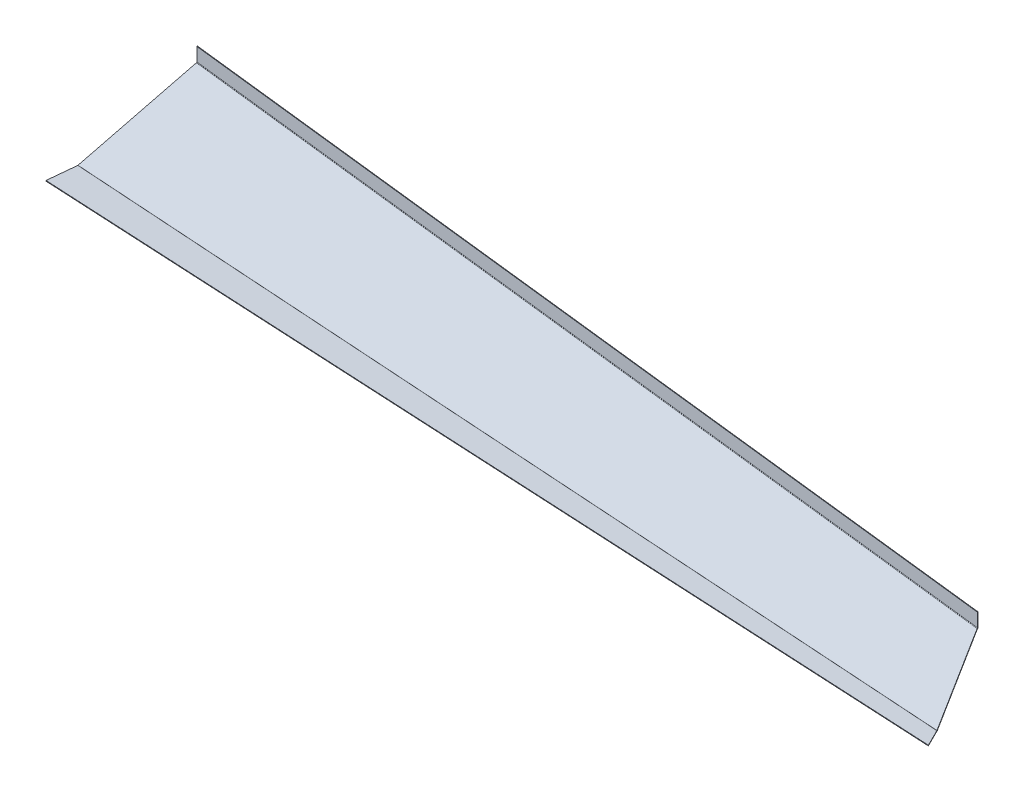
ISO-10303-21;
HEADER;
FILE_DESCRIPTION(('STEP AP214'),'2;1');
FILE_NAME('part.step','',(''),(''),'','','');
FILE_SCHEMA(('AUTOMOTIVE_DESIGN { 1 0 10303 214 1 1 1 1 }'));
ENDSEC;
DATA;
#1=APPLICATION_CONTEXT('core data for automotive mechanical design processes');
#2=APPLICATION_PROTOCOL_DEFINITION('international standard','automotive_design',2000,#1);
#3=PRODUCT_CONTEXT('',#1,'mechanical');
#4=PRODUCT('Part','Part','',(#3));
#5=PRODUCT_RELATED_PRODUCT_CATEGORY('part','',(#4));
#6=PRODUCT_DEFINITION_FORMATION('','',#4);
#7=PRODUCT_DEFINITION_CONTEXT('part definition',#1,'design');
#8=PRODUCT_DEFINITION('design','',#6,#7);
#9=PRODUCT_DEFINITION_SHAPE('','',#8);
#10=(LENGTH_UNIT() NAMED_UNIT(*) SI_UNIT(.MILLI.,.METRE.));
#11=(NAMED_UNIT(*) PLANE_ANGLE_UNIT() SI_UNIT($,.RADIAN.));
#12=(NAMED_UNIT(*) SI_UNIT($,.STERADIAN.) SOLID_ANGLE_UNIT());
#13=UNCERTAINTY_MEASURE_WITH_UNIT(LENGTH_MEASURE(1.E-05),#10,'distance_accuracy_value','');
#14=(GEOMETRIC_REPRESENTATION_CONTEXT(3) GLOBAL_UNCERTAINTY_ASSIGNED_CONTEXT((#13)) GLOBAL_UNIT_ASSIGNED_CONTEXT((#10,
#11,#12)) REPRESENTATION_CONTEXT('',''));
#15=CARTESIAN_POINT('',(0.,0.,0.));
#16=DIRECTION('',(0.,0.,1.));
#17=DIRECTION('',(1.,0.,0.));
#18=AXIS2_PLACEMENT_3D('',#15,#16,#17);
#19=CARTESIAN_POINT('',(2188.04468936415,21.5753010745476,-1143.95409208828));
#20=DIRECTION('',(0.891606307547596,0.156018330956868,-0.425084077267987));
#21=DIRECTION('',(-0.451666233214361,0.23970666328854,-0.859382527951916));
#22=AXIS2_PLACEMENT_3D('',#19,#20,#21);
#23=PLANE('',#22);
#24=DIRECTION('',(-0.0321839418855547,0.95822700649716,0.28419218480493));
#25=VECTOR('',#24,1.);
#26=CARTESIAN_POINT('',(2432.44738637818,-108.133210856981,-678.930603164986));
#27=LINE('',#26,#25);
#28=CARTESIAN_POINT('',(2432.49970459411,-109.690904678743,-679.392585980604));
#29=VERTEX_POINT('',#28);
#30=CARTESIAN_POINT('',(2432.44738637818,-108.133210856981,-678.930603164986));
#31=VERTEX_POINT('',#30);
#32=EDGE_CURVE('E13',#29,#31,#27,.T.);
#33=ORIENTED_EDGE('',*,*,#32,.F.);
#34=DIRECTION('',(-0.451666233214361,0.23970666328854,-0.859382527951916));
#35=VECTOR('',#34,1.);
#36=CARTESIAN_POINT('',(2188.09700758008,20.0176072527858,-1144.4160749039));
#37=LINE('',#36,#35);
#38=CARTESIAN_POINT('',(2313.93589779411,-46.7671516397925,-904.983202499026));
#39=VERTEX_POINT('',#38);
#40=EDGE_CURVE('E254',#29,#39,#37,.T.);
#41=ORIENTED_EDGE('',*,*,#40,.T.);
#42=DIRECTION('',(-0.0321839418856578,0.958227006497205,0.284192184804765));
#43=VECTOR('',#42,1.);
#44=CARTESIAN_POINT('',(2313.88357957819,-45.2094578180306,-904.521219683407));
#45=LINE('',#44,#43);
#46=CARTESIAN_POINT('',(2313.88357957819,-45.2094578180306,-904.521219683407));
#47=VERTEX_POINT('',#46);
#48=EDGE_CURVE('E207',#39,#47,#45,.T.);
#49=ORIENTED_EDGE('',*,*,#48,.T.);
#50=DIRECTION('',(-0.451666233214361,0.23970666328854,-0.859382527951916));
#51=VECTOR('',#50,1.);
#52=CARTESIAN_POINT('',(2188.04468936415,21.5753010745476,-1143.95409208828));
#53=LINE('',#52,#51);
#54=EDGE_CURVE('E256',#31,#47,#53,.T.);
#55=ORIENTED_EDGE('',*,*,#54,.F.);
#56=EDGE_LOOP('',(#33,#41,#49,#55));
#57=FACE_BOUND('',#56,.T.);
#58=ADVANCED_FACE('F194',(#57),#23,.T.);
#59=CARTESIAN_POINT('',(2315.05930535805,-43.6517639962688,-902.284173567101));
#60=CARTESIAN_POINT('',(2314.99833028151,-43.6517639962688,-901.74574852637));
#61=CARTESIAN_POINT('',(2314.93735520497,-43.6517639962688,-901.20732348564));
#62=CARTESIAN_POINT('',(2314.87638012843,-43.6517639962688,-900.66889844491));
#63=CARTESIAN_POINT('',(2315.05930535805,-46.9029639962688,-902.284173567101));
#64=CARTESIAN_POINT('',(2314.99833028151,-47.9866973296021,-901.74574852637));
#65=CARTESIAN_POINT('',(2314.93735520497,-49.0704306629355,-901.20732348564));
#66=CARTESIAN_POINT('',(2314.87638012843,-50.1541639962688,-900.66889844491));
#67=CARTESIAN_POINT('',(2313.23081736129,-46.9029639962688,-905.763226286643));
#68=CARTESIAN_POINT('',(2313.29179243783,-47.9866973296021,-906.301651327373));
#69=CARTESIAN_POINT('',(2313.35276751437,-49.0704306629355,-906.840076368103));
#70=CARTESIAN_POINT('',(2313.41374259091,-50.1541639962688,-907.378501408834));
#71=CARTESIAN_POINT('',(2313.23081736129,-43.6517639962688,-905.763226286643));
#72=CARTESIAN_POINT('',(2313.29179243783,-43.6517639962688,-906.301651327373));
#73=CARTESIAN_POINT('',(2313.35276751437,-43.6517639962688,-906.840076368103));
#74=CARTESIAN_POINT('',(2313.41374259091,-43.6517639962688,-907.378501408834));
#75=CARTESIAN_POINT('',(2313.23081736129,-40.4005639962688,-905.763226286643));
#76=CARTESIAN_POINT('',(2313.29179243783,-39.3168306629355,-906.301651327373));
#77=CARTESIAN_POINT('',(2313.35276751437,-38.2330973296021,-906.840076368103));
#78=CARTESIAN_POINT('',(2313.41374259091,-37.1493639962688,-907.378501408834));
#79=CARTESIAN_POINT('',(2315.05930535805,-40.4005639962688,-902.284173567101));
#80=CARTESIAN_POINT('',(2314.99833028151,-39.3168306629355,-901.74574852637));
#81=CARTESIAN_POINT('',(2314.93735520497,-38.2330973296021,-901.20732348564));
#82=CARTESIAN_POINT('',(2314.87638012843,-37.1493639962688,-900.66889844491));
#83=CARTESIAN_POINT('',(2315.05930535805,-43.6517639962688,-902.284173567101));
#84=CARTESIAN_POINT('',(2314.99833028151,-43.6517639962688,-901.74574852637));
#85=CARTESIAN_POINT('',(2314.93735520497,-43.6517639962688,-901.20732348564));
#86=CARTESIAN_POINT('',(2314.87638012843,-43.6517639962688,-900.66889844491));
#87=(BOUNDED_SURFACE() B_SPLINE_SURFACE(3,3,((#59,#60,#61,#62),(#63,#64,#65,#66),(#67,#68,#69,
#70),(#71,#72,#73,#74),(#75,#76,#77,#78),(#79,#80,#81,#82),(#83,#84,#85,#86)),.UNSPECIFIED.,.T.,
.F.,.F.) B_SPLINE_SURFACE_WITH_KNOTS((4,3,4),(4,4),(0.,0.5,1.),(0.,1.),
.UNSPECIFIED.) GEOMETRIC_REPRESENTATION_ITEM() RATIONAL_B_SPLINE_SURFACE(((1.,1.,1.,1.),
(0.333333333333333,0.333333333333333,0.333333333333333,0.333333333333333),(0.333333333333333,
0.333333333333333,0.333333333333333,0.333333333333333),(1.,1.,1.,1.),(0.333333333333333,
0.333333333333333,0.333333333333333,0.333333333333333),(0.333333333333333,0.333333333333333,
0.333333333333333,0.333333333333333),(1.,1.,1.,1.))) REPRESENTATION_ITEM('') SURFACE());
#88=CARTESIAN_POINT('',(2314.14506135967,-43.6517639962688,-904.023699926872));
#89=DIRECTION('',(0.977054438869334,0.,-0.212989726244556));
#90=DIRECTION('',(0.212989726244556,0.,0.977054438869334));
#91=AXIS2_PLACEMENT_3D('',#88,#89,#90);
#92=ELLIPSE('',#91,3.43358706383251,3.2512);
#93=CARTESIAN_POINT('',(2313.41374259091,-43.6517639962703,-907.378501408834));
#94=VERTEX_POINT('',#93);
#95=EDGE_CURVE('E434',#39,#94,#92,.T.);
#96=DIRECTION('',(-0.11252782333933,4.67514915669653E-13,0.993648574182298));
#97=VECTOR('',#96,1.);
#98=CARTESIAN_POINT('',(2313.23081736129,-43.6517639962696,-905.763226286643));
#99=LINE('',#98,#97);
#100=CARTESIAN_POINT('',(2313.23081736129,-43.6517639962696,-905.763226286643));
#101=VERTEX_POINT('',#100);
#102=EDGE_CURVE('E337',#94,#101,#99,.T.);
#103=CARTESIAN_POINT('',(2314.14506135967,-43.6517639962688,-904.023699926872));
#104=DIRECTION('',(0.885189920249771,0.,-0.465229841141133));
#105=DIRECTION('',(0.465229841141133,0.,0.885189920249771));
#106=AXIS2_PLACEMENT_3D('',#103,#104,#105);
#107=ELLIPSE('',#106,1.96514478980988,1.6256);
#108=EDGE_CURVE('E399',#47,#101,#107,.T.);
#109=ORIENTED_EDGE('',*,*,#48,.F.);
#110=ORIENTED_EDGE('',*,*,#95,.T.);
#111=ORIENTED_EDGE('',*,*,#102,.T.);
#112=ORIENTED_EDGE('',*,*,#108,.F.);
#113=EDGE_LOOP('',(#109,#110,#111,#112));
#114=FACE_BOUND('',#113,.T.);
#115=ADVANCED_FACE('F509',(#114),#87,.F.);
#116=CARTESIAN_POINT('',(2313.23081736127,1.54292377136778E-10,-905.763226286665));
#117=DIRECTION('',(0.993648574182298,3.17557654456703E-13,0.11252782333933));
#118=DIRECTION('',(2.62932274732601E-13,-1.,5.00279601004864E-13));
#119=AXIS2_PLACEMENT_3D('',#116,#117,#118);
#120=PLANE('',#119);
#121=ORIENTED_EDGE('',*,*,#102,.F.);
#122=DIRECTION('',(0.,1.,-4.64545529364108E-13));
#123=VECTOR('',#122,1.);
#124=CARTESIAN_POINT('',(2313.41374259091,-5.43981572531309E-10,-907.378501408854));
#125=LINE('',#124,#123);
#126=CARTESIAN_POINT('',(2313.41374259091,-7.97559999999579,-907.37850140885));
#127=VERTEX_POINT('',#126);
#128=EDGE_CURVE('E293',#127,#94,#125,.F.);
#129=ORIENTED_EDGE('',*,*,#128,.F.);
#130=DIRECTION('',(-0.11252782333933,4.67514915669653E-13,0.993648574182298));
#131=VECTOR('',#130,1.);
#132=CARTESIAN_POINT('',(2313.23081736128,-7.97559999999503,-905.763226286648));
#133=LINE('',#132,#131);
#134=CARTESIAN_POINT('',(2313.23081736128,-7.97559999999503,-905.763226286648));
#135=VERTEX_POINT('',#134);
#136=EDGE_CURVE('E333',#127,#135,#133,.T.);
#137=ORIENTED_EDGE('',*,*,#136,.T.);
#138=DIRECTION('',(2.62932274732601E-13,-1.,5.00279601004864E-13));
#139=VECTOR('',#138,1.);
#140=CARTESIAN_POINT('',(2313.23081736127,1.54292377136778E-10,-905.763226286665));
#141=LINE('',#140,#139);
#142=EDGE_CURVE('E384',#135,#101,#141,.T.);
#143=ORIENTED_EDGE('',*,*,#142,.T.);
#144=EDGE_LOOP('',(#121,#129,#137,#143));
#145=FACE_BOUND('',#144,.T.);
#146=ADVANCED_FACE('F463',(#145),#120,.T.);
#147=CARTESIAN_POINT('',(-32.8420992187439,-7.97559999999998,-1171.449189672));
#148=DIRECTION('',(0.,1.,-4.64781508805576E-13));
#149=DIRECTION('',(0.993648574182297,0.,0.11252782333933));
#150=AXIS2_PLACEMENT_3D('',#147,#148,#149);
#151=PLANE('',#150);
#152=ORIENTED_EDGE('',*,*,#136,.F.);
#153=DIRECTION('',(-0.993648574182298,0.,-0.11252782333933));
#154=VECTOR('',#153,1.);
#155=CARTESIAN_POINT('',(130.869125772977,-7.97560000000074,-1154.54535843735));
#156=LINE('',#155,#154);
#157=CARTESIAN_POINT('',(-32.6467565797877,-7.97560000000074,-1173.06305855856));
#158=VERTEX_POINT('',#157);
#159=EDGE_CURVE('E298',#158,#127,#156,.F.);
#160=ORIENTED_EDGE('',*,*,#159,.F.);
#161=DIRECTION('',(-0.11252782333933,4.67514915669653E-13,0.993648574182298));
#162=VECTOR('',#161,1.);
#163=CARTESIAN_POINT('',(-32.8296818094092,-7.97559999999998,-1171.44778343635));
#164=LINE('',#163,#162);
#165=CARTESIAN_POINT('',(-32.8296818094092,-7.97559999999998,-1171.44778343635));
#166=VERTEX_POINT('',#165);
#167=EDGE_CURVE('E329',#158,#166,#164,.T.);
#168=ORIENTED_EDGE('',*,*,#167,.T.);
#169=DIRECTION('',(0.993648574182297,0.,0.11252782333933));
#170=VECTOR('',#169,1.);
#171=CARTESIAN_POINT('',(-32.8420992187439,-7.97559999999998,-1171.449189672));
#172=LINE('',#171,#170);
#173=EDGE_CURVE('E380',#166,#135,#172,.T.);
#174=ORIENTED_EDGE('',*,*,#173,.T.);
#175=EDGE_LOOP('',(#152,#160,#168,#174));
#176=FACE_BOUND('',#175,.T.);
#177=ADVANCED_FACE('F458',(#176),#151,.T.);
#178=CARTESIAN_POINT('',(-32.8446447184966,-0.323885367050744,-1171.44947794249));
#179=DIRECTION('',(0.99364664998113,0.00196799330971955,0.112527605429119));
#180=DIRECTION('',(0.00195549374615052,-0.999998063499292,0.000221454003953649));
#181=AXIS2_PLACEMENT_3D('',#178,#179,#180);
#182=PLANE('',#181);
#183=ORIENTED_EDGE('',*,*,#167,.F.);
#184=DIRECTION('',(0.00195549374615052,-0.999998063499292,0.000221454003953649));
#185=VECTOR('',#184,1.);
#186=CARTESIAN_POINT('',(-32.6617194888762,-0.323885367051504,-1173.06475306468));
#187=LINE('',#186,#185);
#188=CARTESIAN_POINT('',(-32.5769919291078,-43.6517639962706,-1173.05515791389));
#189=VERTEX_POINT('',#188);
#190=EDGE_CURVE('E287',#158,#189,#187,.T.);
#191=ORIENTED_EDGE('',*,*,#190,.T.);
#192=DIRECTION('',(-0.112527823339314,4.74886582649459E-13,0.993648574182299));
#193=VECTOR('',#192,1.);
#194=CARTESIAN_POINT('',(-32.7599171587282,-43.6517639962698,-1171.4398827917));
#195=LINE('',#194,#193);
#196=CARTESIAN_POINT('',(-32.7599171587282,-43.6517639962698,-1171.4398827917));
#197=VERTEX_POINT('',#196);
#198=EDGE_CURVE('E325',#189,#197,#195,.T.);
#199=ORIENTED_EDGE('',*,*,#198,.T.);
#200=DIRECTION('',(0.00195549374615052,-0.999998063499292,0.000221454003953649));
#201=VECTOR('',#200,1.);
#202=CARTESIAN_POINT('',(-32.8446447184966,-0.323885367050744,-1171.44947794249));
#203=LINE('',#202,#201);
#204=EDGE_CURVE('E376',#166,#197,#203,.T.);
#205=ORIENTED_EDGE('',*,*,#204,.F.);
#206=EDGE_LOOP('',(#183,#191,#199,#205));
#207=FACE_BOUND('',#206,.T.);
#208=ADVANCED_FACE('F454',(#207),#182,.F.);
#209=CARTESIAN_POINT('',(-32.8876456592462,-43.6951706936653,-1168.18294925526));
#210=CARTESIAN_POINT('',(-32.9485989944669,-43.7096395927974,-1167.64471619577));
#211=CARTESIAN_POINT('',(-33.0095523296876,-43.7241084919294,-1167.10648313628));
#212=CARTESIAN_POINT('',(-33.0705056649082,-43.7385773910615,-1166.56825007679));
#213=CARTESIAN_POINT('',(-32.8974145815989,-40.445129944,-1168.09668724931));
#214=CARTESIAN_POINT('',(-32.9616242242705,-39.376251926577,-1167.52970018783));
#215=CARTESIAN_POINT('',(-33.0258338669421,-38.307373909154,-1166.96271312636));
#216=CARTESIAN_POINT('',(-33.0900435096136,-37.238495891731,-1166.39572606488));
#217=CARTESIAN_POINT('',(-32.7697937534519,-40.3583165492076,-1171.35304964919));
#218=CARTESIAN_POINT('',(-32.7120967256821,-39.2605007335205,-1171.86252870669));
#219=CARTESIAN_POINT('',(-32.6543996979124,-38.1626849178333,-1172.3720077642));
#220=CARTESIAN_POINT('',(-32.5967026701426,-37.0648691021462,-1172.8814868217));
#221=CARTESIAN_POINT('',(-32.7600248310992,-43.6083572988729,-1171.43931165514));
#222=CARTESIAN_POINT('',(-32.6990714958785,-43.5938883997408,-1171.97754471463));
#223=CARTESIAN_POINT('',(-32.6381181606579,-43.5794195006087,-1172.51577777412));
#224=CARTESIAN_POINT('',(-32.5771648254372,-43.5649506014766,-1173.05401083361));
#225=CARTESIAN_POINT('',(-32.7502559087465,-46.8583980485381,-1171.5255736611));
#226=CARTESIAN_POINT('',(-32.686046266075,-47.9272760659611,-1172.09256072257));
#227=CARTESIAN_POINT('',(-32.6218366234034,-48.9961540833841,-1172.65954778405));
#228=CARTESIAN_POINT('',(-32.5576269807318,-50.0650321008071,-1173.22653484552));
#229=CARTESIAN_POINT('',(-32.8778767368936,-46.9452114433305,-1168.26921126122));
#230=CARTESIAN_POINT('',(-32.9355737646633,-48.0430272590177,-1167.75973220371));
#231=CARTESIAN_POINT('',(-32.9932707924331,-49.1408430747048,-1167.25025314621));
#232=CARTESIAN_POINT('',(-33.0509678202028,-50.238658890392,-1166.7407740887));
#233=CARTESIAN_POINT('',(-32.8876456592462,-43.6951706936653,-1168.18294925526));
#234=CARTESIAN_POINT('',(-32.9485989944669,-43.7096395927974,-1167.64471619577));
#235=CARTESIAN_POINT('',(-33.0095523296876,-43.7241084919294,-1167.10648313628));
#236=CARTESIAN_POINT('',(-33.0705056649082,-43.7385773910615,-1166.56825007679));
#237=(BOUNDED_SURFACE() B_SPLINE_SURFACE(3,3,((#209,#210,#211,#212),(#213,#214,#215,#216),(#217,
#218,#219,#220),(#221,#222,#223,#224),(#225,#226,#227,#228),(#229,#230,#231,#232),(#233,#234,
#235,#236)),.UNSPECIFIED.,.T.,.F.,.F.) B_SPLINE_SURFACE_WITH_KNOTS((4,3,4),(4,4),(0.,0.5,1.),
(0.,1.),.UNSPECIFIED.) GEOMETRIC_REPRESENTATION_ITEM() RATIONAL_B_SPLINE_SURFACE(((1.,1.,1.,1.),
(0.333333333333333,0.333333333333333,0.333333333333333,0.333333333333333),(0.333333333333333,
0.333333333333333,0.333333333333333,0.333333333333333),(1.,1.,1.,1.),(0.333333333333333,
0.333333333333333,0.333333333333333,0.333333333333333),(0.333333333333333,0.333333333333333,
0.333333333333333,0.333333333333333),(1.,1.,1.,1.))) REPRESENTATION_ITEM('') SURFACE());
#238=CARTESIAN_POINT('',(-32.8238352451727,-43.6517639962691,-1169.8111304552));
#239=DIRECTION('',(-0.997117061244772,-0.000983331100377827,-0.0758722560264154));
#240=DIRECTION('',(-0.0758191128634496,-0.0266838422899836,0.996764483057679));
#241=AXIS2_PLACEMENT_3D('',#238,#239,#240);
#242=ELLIPSE('',#241,3.25340683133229,3.2512);
#243=CARTESIAN_POINT('',(-32.7501898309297,-46.7671516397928,-1170.73860572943));
#244=VERTEX_POINT('',#243);
#245=EDGE_CURVE('E300',#189,#244,#242,.T.);
#246=DIRECTION('',(-0.0321839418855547,0.95822700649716,0.28419218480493));
#247=VECTOR('',#246,1.);
#248=CARTESIAN_POINT('',(-32.8025080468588,-45.2094578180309,-1170.27662291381));
#249=LINE('',#248,#247);
#250=CARTESIAN_POINT('',(-32.8025080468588,-45.2094578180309,-1170.27662291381));
#251=VERTEX_POINT('',#250);
#252=EDGE_CURVE('E322',#244,#251,#249,.T.);
#253=CARTESIAN_POINT('',(-32.8238352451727,-43.6517639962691,-1169.8111304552));
#254=DIRECTION('',(-0.999228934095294,-0.00196267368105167,-0.0392133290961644));
#255=DIRECTION('',(-0.0391472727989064,-0.0266297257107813,0.998878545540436));
#256=AXIS2_PLACEMENT_3D('',#253,#254,#255);
#257=ELLIPSE('',#256,1.63000918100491,1.6256);
#258=EDGE_CURVE('E395',#197,#251,#257,.T.);
#259=ORIENTED_EDGE('',*,*,#198,.F.);
#260=ORIENTED_EDGE('',*,*,#245,.T.);
#261=ORIENTED_EDGE('',*,*,#252,.T.);
#262=ORIENTED_EDGE('',*,*,#258,.F.);
#263=EDGE_LOOP('',(#259,#260,#261,#262));
#264=FACE_BOUND('',#263,.T.);
#265=ADVANCED_FACE('F448',(#264),#237,.F.);
#266=CARTESIAN_POINT('',(-73.7770093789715,-360.934924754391,-110.367293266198));
#267=DIRECTION('',(0.998795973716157,0.0203014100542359,0.0446593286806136));
#268=DIRECTION('',(0.037024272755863,0.285287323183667,-0.95772665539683));
#269=AXIS2_PLACEMENT_3D('',#266,#267,#268);
#270=PLANE('',#269);
#271=ORIENTED_EDGE('',*,*,#252,.F.);
#272=DIRECTION('',(0.037024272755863,0.285287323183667,-0.95772665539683));
#273=VECTOR('',#272,1.);
#274=CARTESIAN_POINT('',(-73.7246911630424,-362.492618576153,-110.829276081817));
#275=LINE('',#274,#273);
#276=CARTESIAN_POINT('',(-44.4969279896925,-137.280623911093,-866.879450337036));
#277=VERTEX_POINT('',#276);
#278=EDGE_CURVE('E286',#277,#244,#275,.T.);
#279=ORIENTED_EDGE('',*,*,#278,.F.);
#280=DIRECTION('',(-0.0321839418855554,0.958227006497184,0.284192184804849));
#281=VECTOR('',#280,1.);
#282=CARTESIAN_POINT('',(-44.5492462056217,-135.722930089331,-866.417467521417));
#283=LINE('',#282,#281);
#284=CARTESIAN_POINT('',(-44.5492462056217,-135.722930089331,-866.417467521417));
#285=VERTEX_POINT('',#284);
#286=EDGE_CURVE('E318',#277,#285,#283,.T.);
#287=ORIENTED_EDGE('',*,*,#286,.T.);
#288=DIRECTION('',(0.037024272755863,0.285287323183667,-0.95772665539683));
#289=VECTOR('',#288,1.);
#290=CARTESIAN_POINT('',(-73.7770093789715,-360.934924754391,-110.367293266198));
#291=LINE('',#290,#289);
#292=EDGE_CURVE('E370',#285,#251,#291,.T.);
#293=ORIENTED_EDGE('',*,*,#292,.T.);
#294=EDGE_LOOP('',(#271,#279,#287,#293));
#295=FACE_BOUND('',#294,.T.);
#296=ADVANCED_FACE('F506',(#295),#270,.F.);
#297=CARTESIAN_POINT('',(-44.7565436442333,-133.371065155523,-862.805239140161));
#298=CARTESIAN_POINT('',(-44.7154178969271,-133.503256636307,-863.329122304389));
#299=CARTESIAN_POINT('',(-44.6742921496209,-133.635448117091,-863.853005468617));
#300=CARTESIAN_POINT('',(-44.6331664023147,-133.767639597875,-864.376888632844));
#301=CARTESIAN_POINT('',(-44.70664316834,-127.065539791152,-864.392395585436));
#302=CARTESIAN_POINT('',(-44.673834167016,-128.248652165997,-864.651752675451));
#303=CARTESIAN_POINT('',(-44.6410251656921,-129.431764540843,-864.911109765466));
#304=CARTESIAN_POINT('',(-44.6082161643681,-130.614876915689,-865.170466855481));
#305=CARTESIAN_POINT('',(-44.3346129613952,-128.653190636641,-870.688188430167));
#306=CARTESIAN_POINT('',(-44.3840554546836,-129.571920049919,-869.899779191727));
#307=CARTESIAN_POINT('',(-44.433497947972,-130.490649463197,-869.111369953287));
#308=CARTESIAN_POINT('',(-44.4829404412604,-131.409378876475,-868.322960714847));
#309=CARTESIAN_POINT('',(-44.3845134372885,-134.958716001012,-869.101031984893));
#310=CARTESIAN_POINT('',(-44.4256391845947,-134.826524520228,-868.577148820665));
#311=CARTESIAN_POINT('',(-44.4667649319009,-134.694333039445,-868.053265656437));
#312=CARTESIAN_POINT('',(-44.507890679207,-134.562141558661,-867.52938249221));
#313=CARTESIAN_POINT('',(-44.4344139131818,-141.264241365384,-867.513875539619));
#314=CARTESIAN_POINT('',(-44.4672229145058,-140.081128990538,-867.254518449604));
#315=CARTESIAN_POINT('',(-44.5000319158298,-138.898016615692,-866.995161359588));
#316=CARTESIAN_POINT('',(-44.5328409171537,-137.714904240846,-866.735804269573));
#317=CARTESIAN_POINT('',(-44.8064441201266,-139.676590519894,-861.218082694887));
#318=CARTESIAN_POINT('',(-44.7570016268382,-138.757861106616,-862.006491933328));
#319=CARTESIAN_POINT('',(-44.7075591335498,-137.839131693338,-862.794901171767));
#320=CARTESIAN_POINT('',(-44.6581166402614,-136.92040228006,-863.583310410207));
#321=CARTESIAN_POINT('',(-44.7565436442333,-133.371065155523,-862.805239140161));
#322=CARTESIAN_POINT('',(-44.7154178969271,-133.503256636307,-863.329122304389));
#323=CARTESIAN_POINT('',(-44.6742921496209,-133.635448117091,-863.853005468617));
#324=CARTESIAN_POINT('',(-44.6331664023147,-133.767639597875,-864.376888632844));
#325=(BOUNDED_SURFACE() B_SPLINE_SURFACE(3,3,((#297,#298,#299,#300),(#301,#302,#303,#304),(#305,
#306,#307,#308),(#309,#310,#311,#312),(#313,#314,#315,#316),(#317,#318,#319,#320),(#321,#322,
#323,#324)),.UNSPECIFIED.,.T.,.F.,.F.) B_SPLINE_SURFACE_WITH_KNOTS((4,3,4),(4,4),(0.,0.5,1.),
(0.,1.),.UNSPECIFIED.) GEOMETRIC_REPRESENTATION_ITEM() RATIONAL_B_SPLINE_SURFACE(((1.,1.,1.,1.),
(0.333333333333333,0.333333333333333,0.333333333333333,0.333333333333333),(0.333333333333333,
0.333333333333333,0.333333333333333,0.333333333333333),(1.,1.,1.,1.),(0.333333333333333,
0.333333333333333,0.333333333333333,0.333333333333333),(0.333333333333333,0.333333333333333,
0.333333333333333,0.333333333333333),(1.,1.,1.,1.))) REPRESENTATION_ITEM('') SURFACE());
#326=CARTESIAN_POINT('',(-44.5705285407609,-134.164890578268,-865.953135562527));
#327=DIRECTION('',(0.99833300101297,0.00653383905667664,0.0573456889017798));
#328=DIRECTION('',(-0.0572042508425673,0.244120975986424,0.968056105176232));
#329=AXIS2_PLACEMENT_3D('',#326,#327,#328);
#330=ELLIPSE('',#329,3.25177064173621,3.2512);
#331=CARTESIAN_POINT('',(-44.5592275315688,-137.411477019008,-865.779966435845));
#332=VERTEX_POINT('',#331);
#333=EDGE_CURVE('E272',#277,#332,#330,.F.);
#334=DIRECTION('',(-0.00706998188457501,0.998540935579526,-0.0535351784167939));
#335=VECTOR('',#334,1.);
#336=CARTESIAN_POINT('',(-44.5707204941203,-135.78824887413,-865.866993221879));
#337=LINE('',#336,#335);
#338=CARTESIAN_POINT('',(-44.5707204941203,-135.78824887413,-865.866993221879));
#339=VERTEX_POINT('',#338);
#340=EDGE_CURVE('E312',#332,#339,#337,.T.);
#341=CARTESIAN_POINT('',(-44.5705285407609,-134.164890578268,-865.953135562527));
#342=DIRECTION('',(0.999228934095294,0.00196267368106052,0.039213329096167));
#343=DIRECTION('',(-0.0385051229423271,0.24420051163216,0.968959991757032));
#344=AXIS2_PLACEMENT_3D('',#341,#342,#343);
#345=ELLIPSE('',#344,1.62674098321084,1.6256);
#346=EDGE_CURVE('E391',#285,#339,#345,.F.);
#347=ORIENTED_EDGE('',*,*,#286,.F.);
#348=ORIENTED_EDGE('',*,*,#333,.T.);
#349=ORIENTED_EDGE('',*,*,#340,.T.);
#350=ORIENTED_EDGE('',*,*,#346,.F.);
#351=EDGE_LOOP('',(#347,#348,#349,#350));
#352=FACE_BOUND('',#351,.T.);
#353=ADVANCED_FACE('F501',(#352),#325,.T.);
#354=CARTESIAN_POINT('',(-47.7749670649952,-131.44504579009,-784.434182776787));
#355=DIRECTION('',(0.999203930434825,0.00915641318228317,0.0388286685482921));
#356=DIRECTION('',(0.0392622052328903,-0.0532180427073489,-0.997810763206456));
#357=AXIS2_PLACEMENT_3D('',#354,#355,#356);
#358=PLANE('',#357);
#359=ORIENTED_EDGE('',*,*,#340,.F.);
#360=DIRECTION('',(0.0392622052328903,-0.0532180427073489,-0.997810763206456));
#361=VECTOR('',#360,1.);
#362=CARTESIAN_POINT('',(-47.7634741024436,-133.068273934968,-784.347155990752));
#363=LINE('',#362,#361);
#364=CARTESIAN_POINT('',(-47.7634741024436,-133.068273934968,-784.347155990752));
#365=VERTEX_POINT('',#364);
#366=EDGE_CURVE('E410',#365,#332,#363,.T.);
#367=ORIENTED_EDGE('',*,*,#366,.F.);
#368=DIRECTION('',(-0.00706998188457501,0.998540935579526,-0.0535351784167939));
#369=VECTOR('',#368,1.);
#370=CARTESIAN_POINT('',(-47.7749670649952,-131.44504579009,-784.434182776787));
#371=LINE('',#370,#369);
#372=CARTESIAN_POINT('',(-47.7749670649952,-131.44504579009,-784.434182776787));
#373=VERTEX_POINT('',#372);
#374=EDGE_CURVE('E308',#365,#373,#371,.T.);
#375=ORIENTED_EDGE('',*,*,#374,.T.);
#376=DIRECTION('',(0.0392622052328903,-0.0532180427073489,-0.997810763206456));
#377=VECTOR('',#376,1.);
#378=CARTESIAN_POINT('',(-47.7749670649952,-131.44504579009,-784.434182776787));
#379=LINE('',#378,#377);
#380=EDGE_CURVE('E358',#373,#339,#379,.T.);
#381=ORIENTED_EDGE('',*,*,#380,.T.);
#382=EDGE_LOOP('',(#359,#367,#375,#381));
#383=FACE_BOUND('',#382,.T.);
#384=ADVANCED_FACE('F544',(#383),#358,.F.);
#385=CARTESIAN_POINT('',(-47.7749670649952,-131.44504579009,-784.434182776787));
#386=DIRECTION('',(-0.0616768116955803,0.0529991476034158,0.996688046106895));
#387=DIRECTION('',(0.998071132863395,0.0103484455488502,0.0612121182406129));
#388=AXIS2_PLACEMENT_3D('',#385,#386,#387);
#389=PLANE('',#388);
#390=ORIENTED_EDGE('',*,*,#374,.F.);
#391=DIRECTION('',(0.998071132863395,0.0103484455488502,0.0612121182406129));
#392=VECTOR('',#391,1.);
#393=CARTESIAN_POINT('',(-47.7634741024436,-133.068273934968,-784.347155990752));
#394=LINE('',#393,#392);
#395=CARTESIAN_POINT('',(2457.7713686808,-107.089773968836,-630.681660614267));
#396=VERTEX_POINT('',#395);
#397=EDGE_CURVE('E417',#365,#396,#394,.T.);
#398=ORIENTED_EDGE('',*,*,#397,.T.);
#399=DIRECTION('',(-0.00706998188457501,0.998540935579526,-0.0535351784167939));
#400=VECTOR('',#399,1.);
#401=CARTESIAN_POINT('',(2457.75987571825,-105.466545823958,-630.768687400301));
#402=LINE('',#401,#400);
#403=CARTESIAN_POINT('',(2457.75987571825,-105.466545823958,-630.768687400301));
#404=VERTEX_POINT('',#403);
#405=EDGE_CURVE('E304',#396,#404,#402,.T.);
#406=ORIENTED_EDGE('',*,*,#405,.T.);
#407=DIRECTION('',(0.998071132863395,0.0103484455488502,0.0612121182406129));
#408=VECTOR('',#407,1.);
#409=CARTESIAN_POINT('',(-47.7749670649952,-131.44504579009,-784.434182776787));
#410=LINE('',#409,#408);
#411=EDGE_CURVE('E366',#373,#404,#410,.T.);
#412=ORIENTED_EDGE('',*,*,#411,.F.);
#413=EDGE_LOOP('',(#390,#398,#406,#412));
#414=FACE_BOUND('',#413,.T.);
#415=ADVANCED_FACE('F488',(#414),#389,.T.);
#416=CARTESIAN_POINT('',(2188.74950190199,-134.812941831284,-1142.61304966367));
#417=DIRECTION('',(0.885475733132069,-0.0186239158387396,-0.46431226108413));
#418=DIRECTION('',(-0.464631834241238,-0.0506867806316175,-0.884052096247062));
#419=AXIS2_PLACEMENT_3D('',#416,#417,#418);
#420=PLANE('',#419);
#421=ORIENTED_EDGE('',*,*,#405,.F.);
#422=DIRECTION('',(-0.464631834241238,-0.0506867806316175,-0.884052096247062));
#423=VECTOR('',#422,1.);
#424=CARTESIAN_POINT('',(2188.76099486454,-136.436169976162,-1142.52602287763));
#425=LINE('',#424,#423);
#426=CARTESIAN_POINT('',(2432.76106814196,-109.818152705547,-678.268603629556));
#427=VERTEX_POINT('',#426);
#428=EDGE_CURVE('E414',#396,#427,#425,.T.);
#429=ORIENTED_EDGE('',*,*,#428,.T.);
#430=DIRECTION('',(-0.00706998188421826,0.998540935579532,-0.0535351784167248));
#431=VECTOR('',#430,1.);
#432=CARTESIAN_POINT('',(2432.74957517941,-108.194924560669,-678.355630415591));
#433=LINE('',#432,#431);
#434=CARTESIAN_POINT('',(2432.74957517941,-108.194924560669,-678.355630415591));
#435=VERTEX_POINT('',#434);
#436=EDGE_CURVE('E200',#427,#435,#433,.T.);
#437=ORIENTED_EDGE('',*,*,#436,.T.);
#438=DIRECTION('',(-0.464631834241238,-0.0506867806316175,-0.884052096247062));
#439=VECTOR('',#438,1.);
#440=CARTESIAN_POINT('',(2188.74950190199,-134.812941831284,-1142.61304966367));
#441=LINE('',#440,#439);
#442=EDGE_CURVE('E362',#404,#435,#441,.T.);
#443=ORIENTED_EDGE('',*,*,#442,.F.);
#444=EDGE_LOOP('',(#421,#429,#437,#443));
#445=FACE_BOUND('',#444,.T.);
#446=ADVANCED_FACE('F496',(#445),#420,.T.);
#447=CARTESIAN_POINT('',(2433.47159330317,-106.503135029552,-675.1271495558));
#448=CARTESIAN_POINT('',(2433.51259084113,-106.512743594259,-675.667377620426));
#449=CARTESIAN_POINT('',(2433.5535883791,-106.522352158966,-676.207605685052));
#450=CARTESIAN_POINT('',(2433.59458591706,-106.531960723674,-676.747833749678));
#451=CARTESIAN_POINT('',(2433.53488808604,-113.004111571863,-675.006718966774));
#452=CARTESIAN_POINT('',(2433.56533649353,-111.930224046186,-675.567018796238));
#453=CARTESIAN_POINT('',(2433.59578490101,-110.856336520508,-676.127318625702));
#454=CARTESIAN_POINT('',(2433.62623330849,-109.78244899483,-676.687618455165));
#455=CARTESIAN_POINT('',(2431.99653684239,-113.142028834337,-681.64313324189));
#456=CARTESIAN_POINT('',(2431.94499017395,-112.048924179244,-681.122976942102));
#457=CARTESIAN_POINT('',(2431.89344350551,-110.955819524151,-680.602820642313));
#458=CARTESIAN_POINT('',(2431.84189683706,-109.862714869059,-680.082664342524));
#459=CARTESIAN_POINT('',(2431.93324205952,-106.641052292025,-681.763563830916));
#460=CARTESIAN_POINT('',(2431.89224452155,-106.631443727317,-681.22333576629));
#461=CARTESIAN_POINT('',(2431.85124698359,-106.62183516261,-680.683107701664));
#462=CARTESIAN_POINT('',(2431.81024944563,-106.612226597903,-680.142879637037));
#463=CARTESIAN_POINT('',(2431.86994727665,-100.140075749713,-681.883994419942));
#464=CARTESIAN_POINT('',(2431.83949886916,-101.213963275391,-681.323694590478));
#465=CARTESIAN_POINT('',(2431.80905046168,-102.287850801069,-680.763394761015));
#466=CARTESIAN_POINT('',(2431.77860205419,-103.361738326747,-680.20309493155));
#467=CARTESIAN_POINT('',(2433.4082985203,-100.00215848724,-675.247580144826));
#468=CARTESIAN_POINT('',(2433.45984518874,-101.095263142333,-675.767736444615));
#469=CARTESIAN_POINT('',(2433.51139185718,-102.188367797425,-676.287892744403));
#470=CARTESIAN_POINT('',(2433.56293852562,-103.281472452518,-676.808049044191));
#471=CARTESIAN_POINT('',(2433.47159330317,-106.503135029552,-675.1271495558));
#472=CARTESIAN_POINT('',(2433.51259084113,-106.512743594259,-675.667377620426));
#473=CARTESIAN_POINT('',(2433.5535883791,-106.522352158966,-676.207605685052));
#474=CARTESIAN_POINT('',(2433.59458591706,-106.531960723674,-676.747833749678));
#475=(BOUNDED_SURFACE() B_SPLINE_SURFACE(3,3,((#447,#448,#449,#450),(#451,#452,#453,#454),(#455,
#456,#457,#458),(#459,#460,#461,#462),(#463,#464,#465,#466),(#467,#468,#469,#470),(#471,#472,
#473,#474)),.UNSPECIFIED.,.T.,.F.,.F.) B_SPLINE_SURFACE_WITH_KNOTS((4,3,4),(4,4),(0.,0.5,1.),
(0.,1.),.UNSPECIFIED.) GEOMETRIC_REPRESENTATION_ITEM() RATIONAL_B_SPLINE_SURFACE(((1.,1.,1.,1.),
(0.333333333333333,0.333333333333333,0.333333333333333,0.333333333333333),(0.333333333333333,
0.333333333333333,0.333333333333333,0.333333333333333),(1.,1.,1.,1.),(0.333333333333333,
0.333333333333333,0.333333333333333,0.333333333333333),(0.333333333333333,0.333333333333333,
0.333333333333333,0.333333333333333),(1.,1.,1.,1.))) REPRESENTATION_ITEM('') SURFACE());
#476=CARTESIAN_POINT('',(2432.70241768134,-106.572093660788,-678.445356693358));
#477=DIRECTION('',(-0.974131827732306,-0.0052992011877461,0.225918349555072));
#478=DIRECTION('',(0.225770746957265,0.0202409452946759,0.973970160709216));
#479=AXIS2_PLACEMENT_3D('',#476,#477,#478);
#480=ELLIPSE('',#479,3.4068878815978,3.2512);
#481=EDGE_CURVE('E269',#427,#29,#480,.F.);
#482=CARTESIAN_POINT('',(2432.70241768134,-106.572093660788,-678.445356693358));
#483=DIRECTION('',(-0.885189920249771,0.,0.465229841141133));
#484=DIRECTION('',(0.465127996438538,0.0209231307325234,0.88499614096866));
#485=AXIS2_PLACEMENT_3D('',#482,#483,#484);
#486=ELLIPSE('',#485,1.91811338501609,1.6256);
#487=EDGE_CURVE('E388',#435,#31,#486,.F.);
#488=ORIENTED_EDGE('',*,*,#481,.T.);
#489=ORIENTED_EDGE('',*,*,#32,.T.);
#490=ORIENTED_EDGE('',*,*,#487,.F.);
#491=ORIENTED_EDGE('',*,*,#436,.F.);
#492=EDGE_LOOP('',(#488,#489,#490,#491));
#493=FACE_BOUND('',#492,.T.);
#494=ADVANCED_FACE('F196',(#493),#475,.T.);
#495=CARTESIAN_POINT('',(0.628667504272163,-88.7909259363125,4.76038376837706));
#496=DIRECTION('',(-0.00706998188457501,0.998540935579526,-0.0535351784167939));
#497=DIRECTION('',(0.,0.0535365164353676,0.998565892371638));
#498=AXIS2_PLACEMENT_3D('',#495,#496,#497);
#499=PLANE('',#498);
#500=ORIENTED_EDGE('',*,*,#442,.T.);
#501=DIRECTION('',(-0.997086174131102,-0.0111059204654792,-0.0754706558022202));
#502=VECTOR('',#501,1.);
#503=CARTESIAN_POINT('',(-44.58103571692,-135.788363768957,-865.867773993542));
#504=LINE('',#503,#502);
#505=EDGE_CURVE('E354',#435,#339,#504,.T.);
#506=ORIENTED_EDGE('',*,*,#505,.T.);
#507=ORIENTED_EDGE('',*,*,#380,.F.);
#508=ORIENTED_EDGE('',*,*,#411,.T.);
#509=EDGE_LOOP('',(#500,#506,#507,#508));
#510=FACE_BOUND('',#509,.T.);
#511=ADVANCED_FACE('F495',(#510),#499,.T.);
#512=CARTESIAN_POINT('',(12.0641081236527,-359.190128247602,-106.529065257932));
#513=DIRECTION('',(-0.0321839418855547,0.95822700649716,0.28419218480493));
#514=DIRECTION('',(0.,-0.284339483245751,0.958723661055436));
#515=AXIS2_PLACEMENT_3D('',#512,#513,#514);
#516=PLANE('',#515);
#517=ORIENTED_EDGE('',*,*,#54,.T.);
#518=DIRECTION('',(0.993648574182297,0.,0.11252782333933));
#519=VECTOR('',#518,1.);
#520=CARTESIAN_POINT('',(130.436908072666,-45.2094578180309,-1151.79023179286));
#521=LINE('',#520,#519);
#522=EDGE_CURVE('E344',#47,#251,#521,.F.);
#523=ORIENTED_EDGE('',*,*,#522,.T.);
#524=ORIENTED_EDGE('',*,*,#292,.F.);
#525=DIRECTION('',(-0.997086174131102,-0.0111059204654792,-0.0754706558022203));
#526=VECTOR('',#525,1.);
#527=CARTESIAN_POINT('',(2432.61482494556,-108.131345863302,-678.917929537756));
#528=LINE('',#527,#526);
#529=EDGE_CURVE('E351',#285,#31,#528,.F.);
#530=ORIENTED_EDGE('',*,*,#529,.T.);
#531=EDGE_LOOP('',(#517,#523,#524,#530));
#532=FACE_BOUND('',#531,.T.);
#533=ADVANCED_FACE('F508',(#532),#516,.T.);
#534=CARTESIAN_POINT('',(130.686200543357,-5.43221580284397E-10,-1152.93008331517));
#535=DIRECTION('',(0.11252782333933,-4.67514915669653E-13,-0.993648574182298));
#536=DIRECTION('',(-0.993648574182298,0.,-0.11252782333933));
#537=AXIS2_PLACEMENT_3D('',#534,#535,#536);
#538=PLANE('',#537);
#539=ORIENTED_EDGE('',*,*,#204,.T.);
#540=DIRECTION('',(0.993648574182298,0.,0.11252782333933));
#541=VECTOR('',#540,1.);
#542=CARTESIAN_POINT('',(130.686200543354,-43.6517639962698,-1152.93008331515));
#543=LINE('',#542,#541);
#544=EDGE_CURVE('E347',#197,#101,#543,.T.);
#545=ORIENTED_EDGE('',*,*,#544,.T.);
#546=ORIENTED_EDGE('',*,*,#142,.F.);
#547=ORIENTED_EDGE('',*,*,#173,.F.);
#548=EDGE_LOOP('',(#539,#545,#546,#547));
#549=FACE_BOUND('',#548,.T.);
#550=ADVANCED_FACE('F467',(#549),#538,.F.);
#551=CARTESIAN_POINT('',(66.3899405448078,-132.928971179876,-857.554403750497));
#552=DIRECTION('',(0.997086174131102,0.0111059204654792,0.0754706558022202));
#553=DIRECTION('',(0.0754753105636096,0.,-0.997147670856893));
#554=AXIS2_PLACEMENT_3D('',#551,#552,#553);
#555=CYLINDRICAL_SURFACE('',#554,1.6256);
#556=ORIENTED_EDGE('',*,*,#487,.T.);
#557=ORIENTED_EDGE('',*,*,#529,.F.);
#558=ORIENTED_EDGE('',*,*,#346,.T.);
#559=ORIENTED_EDGE('',*,*,#505,.F.);
#560=EDGE_LOOP('',(#556,#557,#558,#559));
#561=FACE_BOUND('',#560,.T.);
#562=ADVANCED_FACE('F569',(#561),#555,.F.);
#563=CARTESIAN_POINT('',(130.503275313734,-43.651763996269,-1151.31480819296));
#564=DIRECTION('',(0.993648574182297,0.,0.11252782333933));
#565=DIRECTION('',(0.11252782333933,0.,-0.993648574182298));
#566=AXIS2_PLACEMENT_3D('',#563,#564,#565);
#567=CYLINDRICAL_SURFACE('',#566,1.6256);
#568=ORIENTED_EDGE('',*,*,#258,.T.);
#569=ORIENTED_EDGE('',*,*,#522,.F.);
#570=ORIENTED_EDGE('',*,*,#108,.T.);
#571=ORIENTED_EDGE('',*,*,#544,.F.);
#572=EDGE_LOOP('',(#568,#569,#570,#571));
#573=FACE_BOUND('',#572,.T.);
#574=ADVANCED_FACE('F472',(#573),#567,.F.);
#575=CARTESIAN_POINT('',(0.640160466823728,-90.4141540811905,4.8474105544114));
#576=DIRECTION('',(-0.00706998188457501,0.998540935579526,-0.0535351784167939));
#577=DIRECTION('',(0.,0.0535365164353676,0.998565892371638));
#578=AXIS2_PLACEMENT_3D('',#575,#576,#577);
#579=PLANE('',#578);
#580=ORIENTED_EDGE('',*,*,#428,.F.);
#581=ORIENTED_EDGE('',*,*,#397,.F.);
#582=ORIENTED_EDGE('',*,*,#366,.T.);
#583=DIRECTION('',(0.997086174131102,0.0111059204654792,0.0754706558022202));
#584=VECTOR('',#583,1.);
#585=CARTESIAN_POINT('',(66.4129264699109,-136.175427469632,-857.380350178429));
#586=LINE('',#585,#584);
#587=EDGE_CURVE('E278',#427,#332,#586,.F.);
#588=ORIENTED_EDGE('',*,*,#587,.F.);
#589=EDGE_LOOP('',(#580,#581,#582,#588));
#590=FACE_BOUND('',#589,.T.);
#591=ADVANCED_FACE('F498',(#590),#579,.F.);
#592=CARTESIAN_POINT('',(12.1164263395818,-360.747822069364,-106.991048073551));
#593=DIRECTION('',(-0.0321839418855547,0.95822700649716,0.28419218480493));
#594=DIRECTION('',(0.,-0.284339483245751,0.958723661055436));
#595=AXIS2_PLACEMENT_3D('',#592,#593,#594);
#596=PLANE('',#595);
#597=ORIENTED_EDGE('',*,*,#40,.F.);
#598=DIRECTION('',(0.997086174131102,0.0111059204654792,0.0754706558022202));
#599=VECTOR('',#598,1.);
#600=CARTESIAN_POINT('',(66.4945769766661,-136.0443588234,-858.478369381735));
#601=LINE('',#600,#599);
#602=EDGE_CURVE('E266',#277,#29,#601,.T.);
#603=ORIENTED_EDGE('',*,*,#602,.F.);
#604=ORIENTED_EDGE('',*,*,#278,.T.);
#605=DIRECTION('',(0.993648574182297,0.,0.11252782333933));
#606=VECTOR('',#605,1.);
#607=CARTESIAN_POINT('',(130.607911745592,-46.7671516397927,-1152.23877382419));
#608=LINE('',#607,#606);
#609=EDGE_CURVE('E283',#39,#244,#608,.F.);
#610=ORIENTED_EDGE('',*,*,#609,.F.);
#611=EDGE_LOOP('',(#597,#603,#604,#610));
#612=FACE_BOUND('',#611,.T.);
#613=ADVANCED_FACE('F281',(#612),#596,.F.);
#614=CARTESIAN_POINT('',(130.869125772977,-5.43981572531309E-10,-1154.54535843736));
#615=DIRECTION('',(0.11252782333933,-4.67514915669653E-13,-0.993648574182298));
#616=DIRECTION('',(-0.993648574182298,0.,-0.11252782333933));
#617=AXIS2_PLACEMENT_3D('',#614,#615,#616);
#618=PLANE('',#617);
#619=ORIENTED_EDGE('',*,*,#190,.F.);
#620=ORIENTED_EDGE('',*,*,#159,.T.);
#621=ORIENTED_EDGE('',*,*,#128,.T.);
#622=DIRECTION('',(-0.993648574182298,0.,-0.11252782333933));
#623=VECTOR('',#622,1.);
#624=CARTESIAN_POINT('',(130.869125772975,-43.6517639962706,-1154.54535843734));
#625=LINE('',#624,#623);
#626=EDGE_CURVE('E277',#189,#94,#625,.F.);
#627=ORIENTED_EDGE('',*,*,#626,.F.);
#628=EDGE_LOOP('',(#619,#620,#621,#627));
#629=FACE_BOUND('',#628,.T.);
#630=ADVANCED_FACE('F456',(#629),#618,.T.);
#631=CARTESIAN_POINT('',(66.3899405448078,-132.928971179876,-857.554403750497));
#632=DIRECTION('',(0.997086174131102,0.0111059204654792,0.0754706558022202));
#633=DIRECTION('',(0.0754753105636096,0.,-0.997147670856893));
#634=AXIS2_PLACEMENT_3D('',#631,#632,#633);
#635=CYLINDRICAL_SURFACE('',#634,3.2512);
#636=ORIENTED_EDGE('',*,*,#481,.F.);
#637=ORIENTED_EDGE('',*,*,#587,.T.);
#638=ORIENTED_EDGE('',*,*,#333,.F.);
#639=ORIENTED_EDGE('',*,*,#602,.T.);
#640=EDGE_LOOP('',(#636,#637,#638,#639));
#641=FACE_BOUND('',#640,.T.);
#642=ADVANCED_FACE('F267',(#641),#635,.T.);
#643=CARTESIAN_POINT('',(130.503275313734,-43.651763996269,-1151.31480819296));
#644=DIRECTION('',(0.993648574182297,0.,0.11252782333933));
#645=DIRECTION('',(0.11252782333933,0.,-0.993648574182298));
#646=AXIS2_PLACEMENT_3D('',#643,#644,#645);
#647=CYLINDRICAL_SURFACE('',#646,3.2512);
#648=ORIENTED_EDGE('',*,*,#245,.F.);
#649=ORIENTED_EDGE('',*,*,#626,.T.);
#650=ORIENTED_EDGE('',*,*,#95,.F.);
#651=ORIENTED_EDGE('',*,*,#609,.T.);
#652=EDGE_LOOP('',(#648,#649,#650,#651));
#653=FACE_BOUND('',#652,.T.);
#654=ADVANCED_FACE('F452',(#653),#647,.T.);
#655=CLOSED_SHELL('',(#58,#115,#146,#177,#208,#265,#296,#353,#384,#415,#446,#494,#511,#533,#550,
#562,#574,#591,#613,#630,#642,#654));
#656=MANIFOLD_SOLID_BREP('B2',#655);
#657=ADVANCED_BREP_SHAPE_REPRESENTATION('',(#18,#656),#14);
#658=SHAPE_DEFINITION_REPRESENTATION(#9,#657);
ENDSEC;
END-ISO-10303-21;
